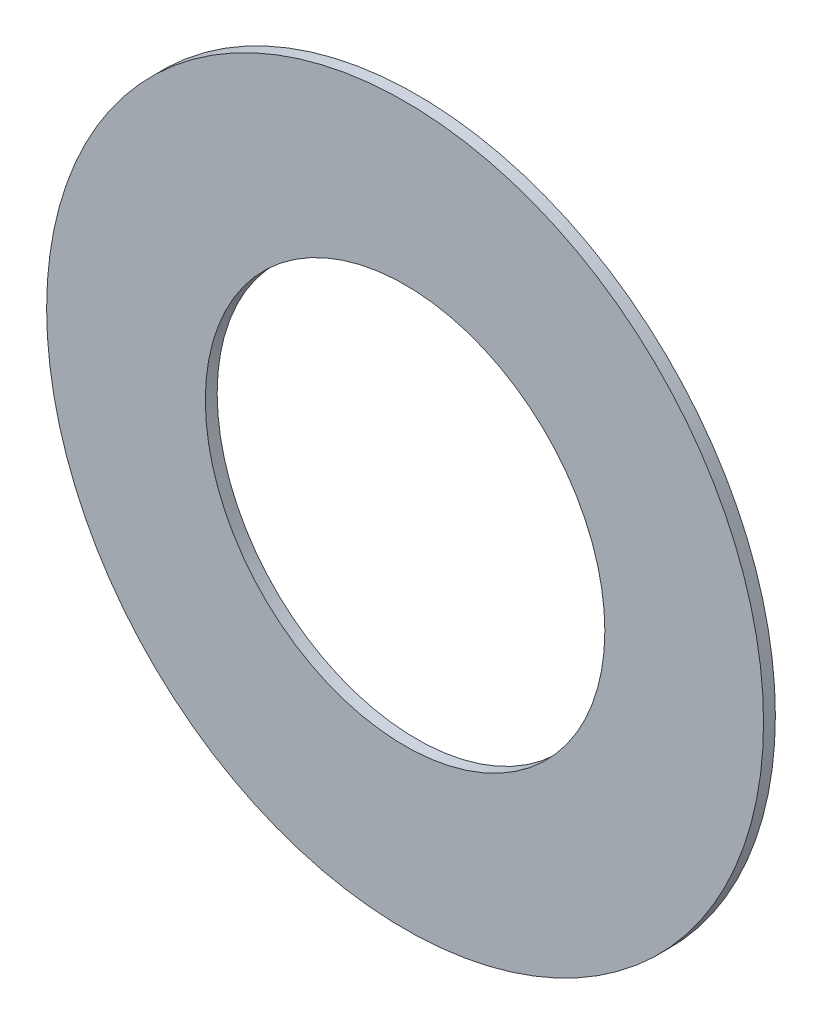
ISO-10303-21;
HEADER;
FILE_DESCRIPTION(('STEP AP214'),'2;1');
FILE_NAME('part.step','',(''),(''),'','','');
FILE_SCHEMA(('AUTOMOTIVE_DESIGN { 1 0 10303 214 1 1 1 1 }'));
ENDSEC;
DATA;
#1=APPLICATION_CONTEXT('core data for automotive mechanical design processes');
#2=APPLICATION_PROTOCOL_DEFINITION('international standard','automotive_design',2000,#1);
#3=PRODUCT_CONTEXT('',#1,'mechanical');
#4=PRODUCT('Part','Part','',(#3));
#5=PRODUCT_RELATED_PRODUCT_CATEGORY('part','',(#4));
#6=PRODUCT_DEFINITION_FORMATION('','',#4);
#7=PRODUCT_DEFINITION_CONTEXT('part definition',#1,'design');
#8=PRODUCT_DEFINITION('design','',#6,#7);
#9=PRODUCT_DEFINITION_SHAPE('','',#8);
#10=(LENGTH_UNIT() NAMED_UNIT(*) SI_UNIT(.MILLI.,.METRE.));
#11=(NAMED_UNIT(*) PLANE_ANGLE_UNIT() SI_UNIT($,.RADIAN.));
#12=(NAMED_UNIT(*) SI_UNIT($,.STERADIAN.) SOLID_ANGLE_UNIT());
#13=UNCERTAINTY_MEASURE_WITH_UNIT(LENGTH_MEASURE(1.E-05),#10,'distance_accuracy_value','');
#14=(GEOMETRIC_REPRESENTATION_CONTEXT(3) GLOBAL_UNCERTAINTY_ASSIGNED_CONTEXT((#13)) GLOBAL_UNIT_ASSIGNED_CONTEXT((#10,
#11,#12)) REPRESENTATION_CONTEXT('',''));
#15=CARTESIAN_POINT('',(0.,0.,0.));
#16=DIRECTION('',(0.,0.,1.));
#17=DIRECTION('',(1.,0.,0.));
#18=AXIS2_PLACEMENT_3D('',#15,#16,#17);
#19=CARTESIAN_POINT('',(0.,0.,1.5875));
#20=DIRECTION('',(0.,0.,1.));
#21=DIRECTION('',(1.,0.,0.));
#22=AXIS2_PLACEMENT_3D('',#19,#20,#21);
#23=PLANE('',#22);
#24=CARTESIAN_POINT('',(0.,0.,1.5875));
#25=DIRECTION('',(0.,0.,1.));
#26=DIRECTION('',(1.,0.,0.));
#27=AXIS2_PLACEMENT_3D('',#24,#25,#26);
#28=CIRCLE('',#27,96.171268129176);
#29=CARTESIAN_POINT('',(96.171268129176,0.,1.5875));
#30=VERTEX_POINT('',#29);
#31=EDGE_CURVE('E10',#30,#30,#28,.T.);
#32=ORIENTED_EDGE('',*,*,#31,.T.);
#33=EDGE_LOOP('',(#32));
#34=FACE_BOUND('',#33,.T.);
#35=CARTESIAN_POINT('',(0.,0.,1.5875));
#36=DIRECTION('',(0.,0.,1.));
#37=DIRECTION('',(1.,0.,0.));
#38=AXIS2_PLACEMENT_3D('',#35,#36,#37);
#39=CIRCLE('',#38,53.594);
#40=CARTESIAN_POINT('',(53.594,0.,1.5875));
#41=VERTEX_POINT('',#40);
#42=EDGE_CURVE('E57',#41,#41,#39,.T.);
#43=ORIENTED_EDGE('',*,*,#42,.F.);
#44=EDGE_LOOP('',(#43));
#45=FACE_BOUND('',#44,.T.);
#46=ADVANCED_FACE('F43',(#34,#45),#23,.T.);
#47=CARTESIAN_POINT('',(0.,0.,-1.5875));
#48=DIRECTION('',(0.,0.,1.));
#49=DIRECTION('',(1.,0.,0.));
#50=AXIS2_PLACEMENT_3D('',#47,#48,#49);
#51=PLANE('',#50);
#52=CARTESIAN_POINT('',(0.,0.,-1.5875));
#53=DIRECTION('',(0.,0.,1.));
#54=DIRECTION('',(1.,0.,0.));
#55=AXIS2_PLACEMENT_3D('',#52,#53,#54);
#56=CIRCLE('',#55,96.171268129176);
#57=CARTESIAN_POINT('',(96.171268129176,0.,-1.5875));
#58=VERTEX_POINT('',#57);
#59=EDGE_CURVE('E50',#58,#58,#56,.T.);
#60=ORIENTED_EDGE('',*,*,#59,.F.);
#61=EDGE_LOOP('',(#60));
#62=FACE_BOUND('',#61,.T.);
#63=CARTESIAN_POINT('',(0.,0.,-1.5875));
#64=DIRECTION('',(0.,0.,1.));
#65=DIRECTION('',(1.,0.,0.));
#66=AXIS2_PLACEMENT_3D('',#63,#64,#65);
#67=CIRCLE('',#66,53.594);
#68=CARTESIAN_POINT('',(53.594,0.,-1.5875));
#69=VERTEX_POINT('',#68);
#70=EDGE_CURVE('E59',#69,#69,#67,.T.);
#71=ORIENTED_EDGE('',*,*,#70,.T.);
#72=EDGE_LOOP('',(#71));
#73=FACE_BOUND('',#72,.T.);
#74=ADVANCED_FACE('F68',(#62,#73),#51,.F.);
#75=CARTESIAN_POINT('',(0.,0.,1.5875));
#76=DIRECTION('',(0.,0.,-1.));
#77=DIRECTION('',(-1.,0.,0.));
#78=AXIS2_PLACEMENT_3D('',#75,#76,#77);
#79=CYLINDRICAL_SURFACE('',#78,96.171268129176);
#80=ORIENTED_EDGE('',*,*,#31,.F.);
#81=EDGE_LOOP('',(#80));
#82=FACE_BOUND('',#81,.T.);
#83=ORIENTED_EDGE('',*,*,#59,.T.);
#84=EDGE_LOOP('',(#83));
#85=FACE_BOUND('',#84,.T.);
#86=ADVANCED_FACE('F44',(#82,#85),#79,.T.);
#87=CARTESIAN_POINT('',(0.,0.,1.5875));
#88=DIRECTION('',(0.,0.,-1.));
#89=DIRECTION('',(-1.,0.,0.));
#90=AXIS2_PLACEMENT_3D('',#87,#88,#89);
#91=CYLINDRICAL_SURFACE('',#90,53.594);
#92=ORIENTED_EDGE('',*,*,#42,.T.);
#93=EDGE_LOOP('',(#92));
#94=FACE_BOUND('',#93,.T.);
#95=ORIENTED_EDGE('',*,*,#70,.F.);
#96=EDGE_LOOP('',(#95));
#97=FACE_BOUND('',#96,.T.);
#98=ADVANCED_FACE('F67',(#94,#97),#91,.F.);
#99=CLOSED_SHELL('',(#46,#74,#86,#98));
#100=MANIFOLD_SOLID_BREP('B2',#99);
#101=ADVANCED_BREP_SHAPE_REPRESENTATION('',(#18,#100),#14);
#102=SHAPE_DEFINITION_REPRESENTATION(#9,#101);
ENDSEC;
END-ISO-10303-21;
